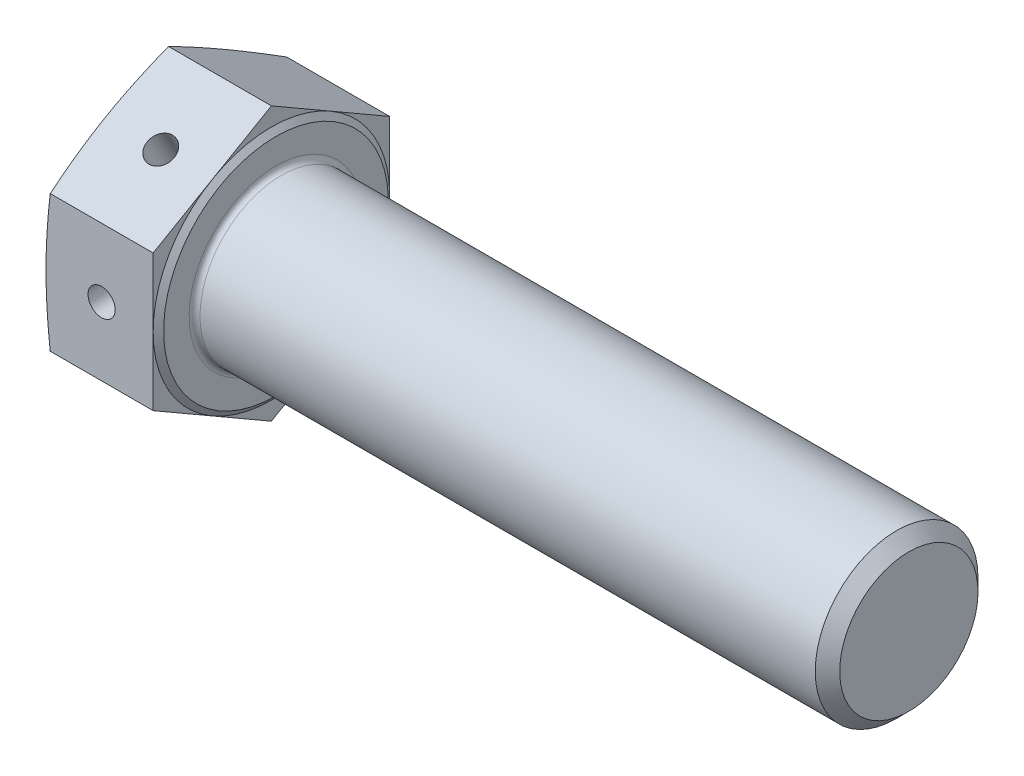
from build123d import *

# Parameters (mm, degrees)
BASEHEAD_DEPTH    = 11.85
SKETCH3_R         = 9
BASEBODY_DEPTH    = 70
CHAMFER1_SIZE     = 1.353
HEADFILLET_R      = 0.6
SKETCH5_R         = 1.5
HOLE_DEPTH        = 85.739153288
CIRPATTERN1_COUNT = 2
CIRPATTERN1_ANGLE = 60


with BuildPart() as part:
    # Sketch-BaseHead → BaseHead (new body)
    with BuildSketch(Plane(origin=(0, 0, 0), x_dir=(0, 0, -1), z_dir=(1, 0, 0))):
        Polygon((0, -15.103483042), (13.08, -7.551741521), (13.08, 7.551741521), (0, 15.103483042), (-13.08, 7.551741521), (-13.08, -7.551741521), align=None)
    extrude(amount=BASEHEAD_DEPTH)

    # Sketch4 → HeadChamfer (revolve, cut)
    with BuildSketch(Plane(origin=(-0.264637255, -5.916896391, 0), x_dir=(0, 1, 0), z_dir=(0, 0, 1))):
        Polygon((21.020379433, -0.264637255), (18.996896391, -0.264637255), (21.020379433, -0.734771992), align=None)
    revolve(axis=Axis((-4.001564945, 0, 0), (1, 0, 0)), mode=Mode.SUBTRACT)

    # Sketch2 → Revolve1 (revolve)
    with BuildSketch(Plane(origin=(0, 0, 0), x_dir=(1, 0, 0), z_dir=(0, 1, 0)), mode=Mode.PRIVATE) as revolve1_sk:
        Polygon((11.85, 0), (12.35, 0), (12.35, 12.425), (11.85, 13.08), align=None)
    revolve(revolve1_sk.sketch.rotate(Axis((-4.001564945, 0, 0), (1, 0, 0)), 270), axis=Axis((-4.001564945, 0, 0), (1, 0, 0)))

    # Sketch3 → BaseBody (add)
    with BuildSketch(Plane(origin=(12.35, 0, 0), x_dir=(0, 0, -1), z_dir=(1, 0, 0))):
        with Locations(Location((0, 0, 0), (0, 0, 270))):
            Circle(SKETCH3_R)
    extrude(amount=BASEBODY_DEPTH)

    # Chamfer1
    chamfer1_edges = [part.edges().sort_by_distance(p)[0] for p in [
        (82.35, 9, 0),
    ]]
    chamfer(chamfer1_edges, length=CHAMFER1_SIZE)

    # HeadFillet
    headfillet_edges = [part.edges().sort_by_distance(p)[0] for p in [
        (12.35, 9, 0),
    ]]
    fillet(headfillet_edges, radius=HEADFILLET_R)

    # Sketch5 → Hole (cut, symmetric)
    with BuildSketch(Plane.XY):
        with Locations((6.15, 0)):
            Circle(SKETCH5_R)
    hole = extrude(amount=HOLE_DEPTH, both=True, mode=Mode.SUBTRACT)

    # CirPattern1: Hole ×2 about axis
    cirpattern1_axis = Axis((82.35, 0, 0), (-1, 0, 0))
    for i in range(1, CIRPATTERN1_COUNT):
        add(hole.rotate(cirpattern1_axis, i * CIRPATTERN1_ANGLE / (CIRPATTERN1_COUNT - 1)), mode=Mode.SUBTRACT)


solid = part.part
